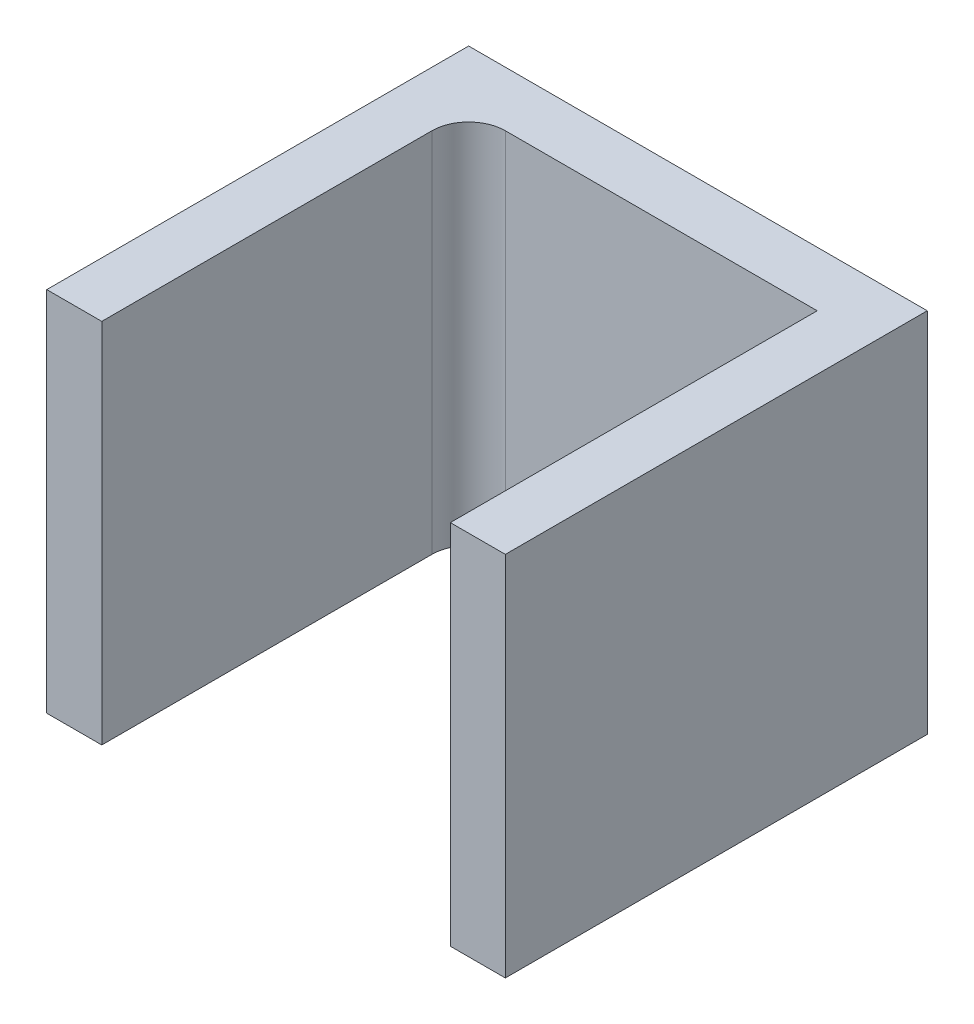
ISO-10303-21;
HEADER;
FILE_DESCRIPTION(('STEP AP214'),'2;1');
FILE_NAME('part.step','',(''),(''),'','','');
FILE_SCHEMA(('AUTOMOTIVE_DESIGN { 1 0 10303 214 1 1 1 1 }'));
ENDSEC;
DATA;
#1=APPLICATION_CONTEXT('core data for automotive mechanical design processes');
#2=APPLICATION_PROTOCOL_DEFINITION('international standard','automotive_design',2000,#1);
#3=PRODUCT_CONTEXT('',#1,'mechanical');
#4=PRODUCT('Part','Part','',(#3));
#5=PRODUCT_RELATED_PRODUCT_CATEGORY('part','',(#4));
#6=PRODUCT_DEFINITION_FORMATION('','',#4);
#7=PRODUCT_DEFINITION_CONTEXT('part definition',#1,'design');
#8=PRODUCT_DEFINITION('design','',#6,#7);
#9=PRODUCT_DEFINITION_SHAPE('','',#8);
#10=(LENGTH_UNIT() NAMED_UNIT(*) SI_UNIT(.MILLI.,.METRE.));
#11=(NAMED_UNIT(*) PLANE_ANGLE_UNIT() SI_UNIT($,.RADIAN.));
#12=(NAMED_UNIT(*) SI_UNIT($,.STERADIAN.) SOLID_ANGLE_UNIT());
#13=UNCERTAINTY_MEASURE_WITH_UNIT(LENGTH_MEASURE(1.E-05),#10,'distance_accuracy_value','');
#14=(GEOMETRIC_REPRESENTATION_CONTEXT(3) GLOBAL_UNCERTAINTY_ASSIGNED_CONTEXT((#13)) GLOBAL_UNIT_ASSIGNED_CONTEXT((#10,
#11,#12)) REPRESENTATION_CONTEXT('',''));
#15=CARTESIAN_POINT('',(0.,0.,0.));
#16=DIRECTION('',(0.,0.,1.));
#17=DIRECTION('',(1.,0.,0.));
#18=AXIS2_PLACEMENT_3D('',#15,#16,#17);
#19=CARTESIAN_POINT('',(-8.70873786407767,20.,0.));
#20=DIRECTION('',(0.,0.,-1.));
#21=DIRECTION('',(-1.,0.,0.));
#22=AXIS2_PLACEMENT_3D('',#19,#20,#21);
#23=PLANE('',#22);
#24=DIRECTION('',(1.,0.,0.));
#25=VECTOR('',#24,1.);
#26=CARTESIAN_POINT('',(-8.70873786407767,0.,0.));
#27=LINE('',#26,#25);
#28=CARTESIAN_POINT('',(-8.70873786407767,0.,0.));
#29=VERTEX_POINT('',#28);
#30=CARTESIAN_POINT('',(-5.70873786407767,0.,0.));
#31=VERTEX_POINT('',#30);
#32=EDGE_CURVE('E121',#29,#31,#27,.T.);
#33=ORIENTED_EDGE('',*,*,#32,.T.);
#34=DIRECTION('',(0.,-1.,0.));
#35=VECTOR('',#34,1.);
#36=CARTESIAN_POINT('',(-5.70873786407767,20.,0.));
#37=LINE('',#36,#35);
#38=CARTESIAN_POINT('',(-5.70873786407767,20.,0.));
#39=VERTEX_POINT('',#38);
#40=EDGE_CURVE('E104',#39,#31,#37,.T.);
#41=ORIENTED_EDGE('',*,*,#40,.F.);
#42=DIRECTION('',(1.,0.,0.));
#43=VECTOR('',#42,1.);
#44=CARTESIAN_POINT('',(-8.70873786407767,20.,0.));
#45=LINE('',#44,#43);
#46=CARTESIAN_POINT('',(-8.70873786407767,20.,0.));
#47=VERTEX_POINT('',#46);
#48=EDGE_CURVE('E109',#47,#39,#45,.T.);
#49=ORIENTED_EDGE('',*,*,#48,.F.);
#50=DIRECTION('',(0.,-1.,0.));
#51=VECTOR('',#50,1.);
#52=CARTESIAN_POINT('',(-8.70873786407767,20.,0.));
#53=LINE('',#52,#51);
#54=EDGE_CURVE('E143',#47,#29,#53,.T.);
#55=ORIENTED_EDGE('',*,*,#54,.T.);
#56=EDGE_LOOP('',(#33,#41,#49,#55));
#57=FACE_BOUND('',#56,.T.);
#58=ADVANCED_FACE('F33',(#57),#23,.F.);
#59=CARTESIAN_POINT('',(-5.70873786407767,20.,0.));
#60=DIRECTION('',(-1.,0.,0.));
#61=DIRECTION('',(0.,0.,1.));
#62=AXIS2_PLACEMENT_3D('',#59,#60,#61);
#63=PLANE('',#62);
#64=DIRECTION('',(0.,0.,-1.));
#65=VECTOR('',#64,1.);
#66=CARTESIAN_POINT('',(-5.70873786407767,0.,0.));
#67=LINE('',#66,#65);
#68=CARTESIAN_POINT('',(-5.70873786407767,0.,-18.));
#69=VERTEX_POINT('',#68);
#70=EDGE_CURVE('E156',#31,#69,#67,.T.);
#71=ORIENTED_EDGE('',*,*,#70,.T.);
#72=DIRECTION('',(0.,-1.,0.));
#73=VECTOR('',#72,1.);
#74=CARTESIAN_POINT('',(-5.70873786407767,20.,-18.));
#75=LINE('',#74,#73);
#76=CARTESIAN_POINT('',(-5.70873786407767,20.,-18.));
#77=VERTEX_POINT('',#76);
#78=EDGE_CURVE('E48',#69,#77,#75,.F.);
#79=ORIENTED_EDGE('',*,*,#78,.T.);
#80=DIRECTION('',(0.,0.,-1.));
#81=VECTOR('',#80,1.);
#82=CARTESIAN_POINT('',(-5.70873786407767,20.,0.));
#83=LINE('',#82,#81);
#84=EDGE_CURVE('E100',#39,#77,#83,.T.);
#85=ORIENTED_EDGE('',*,*,#84,.F.);
#86=ORIENTED_EDGE('',*,*,#40,.T.);
#87=EDGE_LOOP('',(#71,#79,#85,#86));
#88=FACE_BOUND('',#87,.T.);
#89=ADVANCED_FACE('F102',(#88),#63,.F.);
#90=CARTESIAN_POINT('',(-5.70873786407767,20.,-20.));
#91=DIRECTION('',(0.,0.,-1.));
#92=DIRECTION('',(-1.,0.,0.));
#93=AXIS2_PLACEMENT_3D('',#90,#91,#92);
#94=PLANE('',#93);
#95=DIRECTION('',(1.,0.,0.));
#96=VECTOR('',#95,1.);
#97=CARTESIAN_POINT('',(-5.70873786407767,20.,-20.));
#98=LINE('',#97,#96);
#99=CARTESIAN_POINT('',(-3.70873786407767,20.,-20.));
#100=VERTEX_POINT('',#99);
#101=CARTESIAN_POINT('',(13.2912621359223,20.,-20.));
#102=VERTEX_POINT('',#101);
#103=EDGE_CURVE('E108',#100,#102,#98,.T.);
#104=ORIENTED_EDGE('',*,*,#103,.F.);
#105=DIRECTION('',(0.,-1.,0.));
#106=VECTOR('',#105,1.);
#107=CARTESIAN_POINT('',(-3.70873786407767,0.,-20.));
#108=LINE('',#107,#106);
#109=CARTESIAN_POINT('',(-3.70873786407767,0.,-20.));
#110=VERTEX_POINT('',#109);
#111=EDGE_CURVE('E122',#100,#110,#108,.T.);
#112=ORIENTED_EDGE('',*,*,#111,.T.);
#113=DIRECTION('',(1.,0.,0.));
#114=VECTOR('',#113,1.);
#115=CARTESIAN_POINT('',(-5.70873786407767,0.,-20.));
#116=LINE('',#115,#114);
#117=CARTESIAN_POINT('',(13.2912621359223,0.,-20.));
#118=VERTEX_POINT('',#117);
#119=EDGE_CURVE('E154',#110,#118,#116,.T.);
#120=ORIENTED_EDGE('',*,*,#119,.T.);
#121=DIRECTION('',(0.,-1.,0.));
#122=VECTOR('',#121,1.);
#123=CARTESIAN_POINT('',(13.2912621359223,20.,-20.));
#124=LINE('',#123,#122);
#125=EDGE_CURVE('E123',#102,#118,#124,.T.);
#126=ORIENTED_EDGE('',*,*,#125,.F.);
#127=EDGE_LOOP('',(#104,#112,#120,#126));
#128=FACE_BOUND('',#127,.T.);
#129=ADVANCED_FACE('F174',(#128),#94,.F.);
#130=CARTESIAN_POINT('',(13.2912621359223,20.,-20.));
#131=DIRECTION('',(1.,0.,0.));
#132=DIRECTION('',(0.,0.,-1.));
#133=AXIS2_PLACEMENT_3D('',#130,#131,#132);
#134=PLANE('',#133);
#135=DIRECTION('',(0.,0.,1.));
#136=VECTOR('',#135,1.);
#137=CARTESIAN_POINT('',(13.2912621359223,0.,-20.));
#138=LINE('',#137,#136);
#139=CARTESIAN_POINT('',(13.2912621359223,0.,0.));
#140=VERTEX_POINT('',#139);
#141=EDGE_CURVE('E152',#118,#140,#138,.T.);
#142=ORIENTED_EDGE('',*,*,#141,.T.);
#143=DIRECTION('',(0.,-1.,0.));
#144=VECTOR('',#143,1.);
#145=CARTESIAN_POINT('',(13.2912621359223,20.,0.));
#146=LINE('',#145,#144);
#147=CARTESIAN_POINT('',(13.2912621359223,20.,0.));
#148=VERTEX_POINT('',#147);
#149=EDGE_CURVE('E128',#148,#140,#146,.T.);
#150=ORIENTED_EDGE('',*,*,#149,.F.);
#151=DIRECTION('',(0.,0.,1.));
#152=VECTOR('',#151,1.);
#153=CARTESIAN_POINT('',(13.2912621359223,20.,-20.));
#154=LINE('',#153,#152);
#155=EDGE_CURVE('E166',#102,#148,#154,.T.);
#156=ORIENTED_EDGE('',*,*,#155,.F.);
#157=ORIENTED_EDGE('',*,*,#125,.T.);
#158=EDGE_LOOP('',(#142,#150,#156,#157));
#159=FACE_BOUND('',#158,.T.);
#160=ADVANCED_FACE('F177',(#159),#134,.F.);
#161=CARTESIAN_POINT('',(13.2912621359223,20.,0.));
#162=DIRECTION('',(0.,0.,-1.));
#163=DIRECTION('',(-1.,0.,0.));
#164=AXIS2_PLACEMENT_3D('',#161,#162,#163);
#165=PLANE('',#164);
#166=DIRECTION('',(1.,0.,0.));
#167=VECTOR('',#166,1.);
#168=CARTESIAN_POINT('',(13.2912621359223,0.,0.));
#169=LINE('',#168,#167);
#170=CARTESIAN_POINT('',(16.2912621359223,0.,0.));
#171=VERTEX_POINT('',#170);
#172=EDGE_CURVE('E150',#140,#171,#169,.T.);
#173=ORIENTED_EDGE('',*,*,#172,.T.);
#174=DIRECTION('',(0.,-1.,0.));
#175=VECTOR('',#174,1.);
#176=CARTESIAN_POINT('',(16.2912621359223,20.,0.));
#177=LINE('',#176,#175);
#178=CARTESIAN_POINT('',(16.2912621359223,20.,0.));
#179=VERTEX_POINT('',#178);
#180=EDGE_CURVE('E134',#179,#171,#177,.T.);
#181=ORIENTED_EDGE('',*,*,#180,.F.);
#182=DIRECTION('',(1.,0.,0.));
#183=VECTOR('',#182,1.);
#184=CARTESIAN_POINT('',(13.2912621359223,20.,0.));
#185=LINE('',#184,#183);
#186=EDGE_CURVE('E164',#148,#179,#185,.T.);
#187=ORIENTED_EDGE('',*,*,#186,.F.);
#188=ORIENTED_EDGE('',*,*,#149,.T.);
#189=EDGE_LOOP('',(#173,#181,#187,#188));
#190=FACE_BOUND('',#189,.T.);
#191=ADVANCED_FACE('F182',(#190),#165,.F.);
#192=CARTESIAN_POINT('',(16.2912621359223,20.,0.));
#193=DIRECTION('',(-1.,0.,0.));
#194=DIRECTION('',(0.,0.,1.));
#195=AXIS2_PLACEMENT_3D('',#192,#193,#194);
#196=PLANE('',#195);
#197=DIRECTION('',(0.,0.,-1.));
#198=VECTOR('',#197,1.);
#199=CARTESIAN_POINT('',(16.2912621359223,0.,0.));
#200=LINE('',#199,#198);
#201=CARTESIAN_POINT('',(16.2912621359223,0.,-23.));
#202=VERTEX_POINT('',#201);
#203=EDGE_CURVE('E148',#171,#202,#200,.T.);
#204=ORIENTED_EDGE('',*,*,#203,.T.);
#205=DIRECTION('',(0.,-1.,0.));
#206=VECTOR('',#205,1.);
#207=CARTESIAN_POINT('',(16.2912621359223,20.,-23.));
#208=LINE('',#207,#206);
#209=CARTESIAN_POINT('',(16.2912621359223,20.,-23.));
#210=VERTEX_POINT('',#209);
#211=EDGE_CURVE('E137',#210,#202,#208,.T.);
#212=ORIENTED_EDGE('',*,*,#211,.F.);
#213=DIRECTION('',(0.,0.,-1.));
#214=VECTOR('',#213,1.);
#215=CARTESIAN_POINT('',(16.2912621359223,20.,0.));
#216=LINE('',#215,#214);
#217=EDGE_CURVE('E162',#179,#210,#216,.T.);
#218=ORIENTED_EDGE('',*,*,#217,.F.);
#219=ORIENTED_EDGE('',*,*,#180,.T.);
#220=EDGE_LOOP('',(#204,#212,#218,#219));
#221=FACE_BOUND('',#220,.T.);
#222=ADVANCED_FACE('F188',(#221),#196,.F.);
#223=CARTESIAN_POINT('',(16.2912621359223,20.,-23.));
#224=DIRECTION('',(0.,0.,1.));
#225=DIRECTION('',(1.,0.,0.));
#226=AXIS2_PLACEMENT_3D('',#223,#224,#225);
#227=PLANE('',#226);
#228=DIRECTION('',(-1.,0.,0.));
#229=VECTOR('',#228,1.);
#230=CARTESIAN_POINT('',(16.2912621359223,0.,-23.));
#231=LINE('',#230,#229);
#232=CARTESIAN_POINT('',(-8.70873786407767,0.,-23.));
#233=VERTEX_POINT('',#232);
#234=EDGE_CURVE('E146',#202,#233,#231,.T.);
#235=ORIENTED_EDGE('',*,*,#234,.T.);
#236=DIRECTION('',(0.,-1.,0.));
#237=VECTOR('',#236,1.);
#238=CARTESIAN_POINT('',(-8.70873786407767,20.,-23.));
#239=LINE('',#238,#237);
#240=CARTESIAN_POINT('',(-8.70873786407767,20.,-23.));
#241=VERTEX_POINT('',#240);
#242=EDGE_CURVE('E140',#241,#233,#239,.T.);
#243=ORIENTED_EDGE('',*,*,#242,.F.);
#244=DIRECTION('',(-1.,0.,0.));
#245=VECTOR('',#244,1.);
#246=CARTESIAN_POINT('',(16.2912621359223,20.,-23.));
#247=LINE('',#246,#245);
#248=EDGE_CURVE('E160',#210,#241,#247,.T.);
#249=ORIENTED_EDGE('',*,*,#248,.F.);
#250=ORIENTED_EDGE('',*,*,#211,.T.);
#251=EDGE_LOOP('',(#235,#243,#249,#250));
#252=FACE_BOUND('',#251,.T.);
#253=ADVANCED_FACE('F192',(#252),#227,.F.);
#254=CARTESIAN_POINT('',(-8.70873786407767,20.,-23.));
#255=DIRECTION('',(1.,0.,0.));
#256=DIRECTION('',(0.,0.,-1.));
#257=AXIS2_PLACEMENT_3D('',#254,#255,#256);
#258=PLANE('',#257);
#259=DIRECTION('',(0.,0.,1.));
#260=VECTOR('',#259,1.);
#261=CARTESIAN_POINT('',(-8.70873786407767,0.,-23.));
#262=LINE('',#261,#260);
#263=EDGE_CURVE('E118',#233,#29,#262,.T.);
#264=ORIENTED_EDGE('',*,*,#263,.T.);
#265=ORIENTED_EDGE('',*,*,#54,.F.);
#266=DIRECTION('',(0.,0.,1.));
#267=VECTOR('',#266,1.);
#268=CARTESIAN_POINT('',(-8.70873786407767,20.,-23.));
#269=LINE('',#268,#267);
#270=EDGE_CURVE('E114',#241,#47,#269,.T.);
#271=ORIENTED_EDGE('',*,*,#270,.F.);
#272=ORIENTED_EDGE('',*,*,#242,.T.);
#273=EDGE_LOOP('',(#264,#265,#271,#272));
#274=FACE_BOUND('',#273,.T.);
#275=ADVANCED_FACE('F195',(#274),#258,.F.);
#276=CARTESIAN_POINT('',(0.,20.,0.));
#277=DIRECTION('',(0.,1.,0.));
#278=DIRECTION('',(0.,0.,1.));
#279=AXIS2_PLACEMENT_3D('',#276,#277,#278);
#280=PLANE('',#279);
#281=ORIENTED_EDGE('',*,*,#48,.T.);
#282=ORIENTED_EDGE('',*,*,#84,.T.);
#283=CARTESIAN_POINT('',(-3.70873786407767,20.,-18.));
#284=DIRECTION('',(0.,1.,0.));
#285=DIRECTION('',(0.,0.,1.));
#286=AXIS2_PLACEMENT_3D('',#283,#284,#285);
#287=CIRCLE('',#286,2.);
#288=EDGE_CURVE('E11',#77,#100,#287,.F.);
#289=ORIENTED_EDGE('',*,*,#288,.T.);
#290=ORIENTED_EDGE('',*,*,#103,.T.);
#291=ORIENTED_EDGE('',*,*,#155,.T.);
#292=ORIENTED_EDGE('',*,*,#186,.T.);
#293=ORIENTED_EDGE('',*,*,#217,.T.);
#294=ORIENTED_EDGE('',*,*,#248,.T.);
#295=ORIENTED_EDGE('',*,*,#270,.T.);
#296=EDGE_LOOP('',(#281,#282,#289,#290,#291,#292,#293,#294,#295));
#297=FACE_BOUND('',#296,.T.);
#298=ADVANCED_FACE('F112',(#297),#280,.T.);
#299=CARTESIAN_POINT('',(0.,0.,0.));
#300=DIRECTION('',(0.,1.,0.));
#301=DIRECTION('',(0.,0.,1.));
#302=AXIS2_PLACEMENT_3D('',#299,#300,#301);
#303=PLANE('',#302);
#304=ORIENTED_EDGE('',*,*,#32,.F.);
#305=ORIENTED_EDGE('',*,*,#263,.F.);
#306=ORIENTED_EDGE('',*,*,#234,.F.);
#307=ORIENTED_EDGE('',*,*,#203,.F.);
#308=ORIENTED_EDGE('',*,*,#172,.F.);
#309=ORIENTED_EDGE('',*,*,#141,.F.);
#310=ORIENTED_EDGE('',*,*,#119,.F.);
#311=CARTESIAN_POINT('',(-3.70873786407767,0.,-18.));
#312=DIRECTION('',(0.,1.,0.));
#313=DIRECTION('',(0.,0.,1.));
#314=AXIS2_PLACEMENT_3D('',#311,#312,#313);
#315=CIRCLE('',#314,2.);
#316=EDGE_CURVE('E41',#110,#69,#315,.T.);
#317=ORIENTED_EDGE('',*,*,#316,.T.);
#318=ORIENTED_EDGE('',*,*,#70,.F.);
#319=EDGE_LOOP('',(#304,#305,#306,#307,#308,#309,#310,#317,#318));
#320=FACE_BOUND('',#319,.T.);
#321=ADVANCED_FACE('F196',(#320),#303,.F.);
#322=CARTESIAN_POINT('',(-3.70873786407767,20.,-18.));
#323=DIRECTION('',(0.,1.,0.));
#324=DIRECTION('',(0.,0.,1.));
#325=AXIS2_PLACEMENT_3D('',#322,#323,#324);
#326=CYLINDRICAL_SURFACE('',#325,2.);
#327=ORIENTED_EDGE('',*,*,#288,.F.);
#328=ORIENTED_EDGE('',*,*,#78,.F.);
#329=ORIENTED_EDGE('',*,*,#316,.F.);
#330=ORIENTED_EDGE('',*,*,#111,.F.);
#331=EDGE_LOOP('',(#327,#328,#329,#330));
#332=FACE_BOUND('',#331,.T.);
#333=ADVANCED_FACE('F35',(#332),#326,.F.);
#334=CLOSED_SHELL('',(#58,#89,#129,#160,#191,#222,#253,#275,#298,#321,#333));
#335=MANIFOLD_SOLID_BREP('B2',#334);
#336=ADVANCED_BREP_SHAPE_REPRESENTATION('',(#18,#335),#14);
#337=SHAPE_DEFINITION_REPRESENTATION(#9,#336);
ENDSEC;
END-ISO-10303-21;
